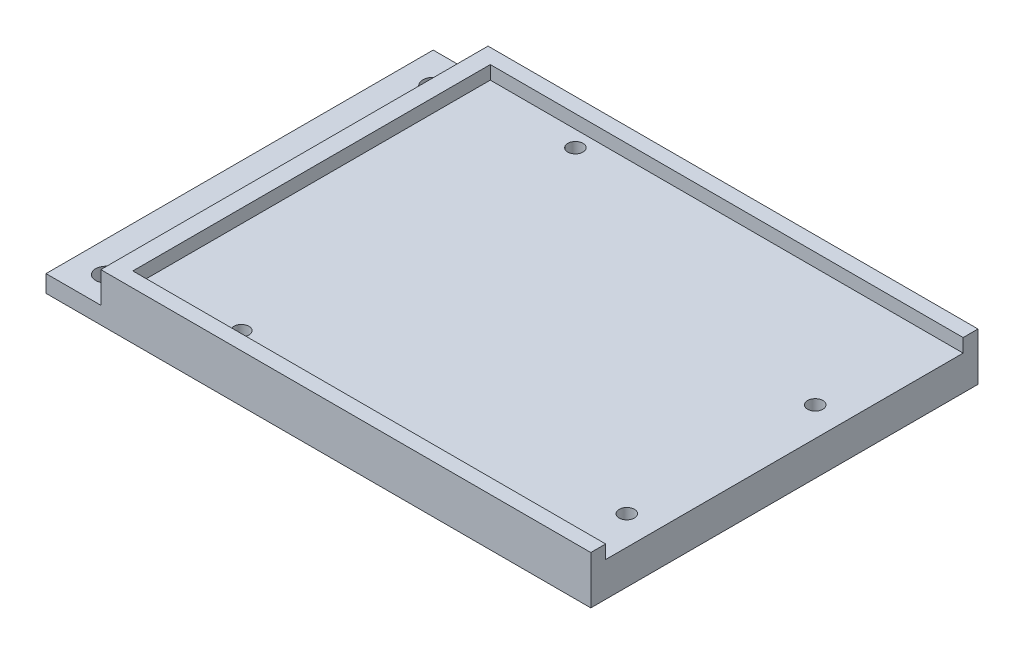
from build123d import *

# Parameters (mm, degrees)
SKETCH1_W               = 80.772
SKETCH1_H               = 57.404
BOSS_EXTRUDE1_DEPTH     = 7.112
CUT_EXTRUDE1_DEPTH      = 71.546642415
CUT_EXTRUDE1_DEPTH_BACK = 71.546642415
SKETCH2_W               = 8.128
SKETCH2_H               = 4.572
CUT_EXTRUDE3_DEPTH      = 51.054114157
CUT_EXTRUDE3_DEPTH_BACK = 51.054114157
SKETCH4_R               = 1.1303
CUT_EXTRUDE2_DEPTH      = 50.756778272
CUT_EXTRUDE2_DEPTH_BACK = 50.756778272
SKETCH3_R               = 1.524
SKETCH5_W               = 70.104
SKETCH5_H               = 52.999999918
CUT_EXTRUDE4_DEPTH      = 2


with BuildPart() as part:
    # Sketch1 → Boss-Extrude1 (new body)
    with BuildSketch(Plane(origin=(0, 0, 0), x_dir=(1, 0, 0), z_dir=(0, 1, 0))):
        Rectangle(SKETCH1_W, SKETCH1_H)
    extrude(amount=BOSS_EXTRUDE1_DEPTH)

    # Sketch2 → Cut-Extrude1 (cut, two sides: drawn at the far end of the back side and taken through both)
    with BuildSketch(Plane.XY.offset(28.702).offset(-CUT_EXTRUDE1_DEPTH_BACK)):
        with Locations((-36.322, 4.826)):
            Rectangle(SKETCH2_W, SKETCH2_H)
    extrude(amount=CUT_EXTRUDE1_DEPTH + CUT_EXTRUDE1_DEPTH_BACK, mode=Mode.SUBTRACT)

    # Sketch4 → Cut-Extrude3 (cut, two sides: drawn at the far end of the back side and taken through both)
    with BuildSketch(Plane(origin=(0, 7.112, 0), x_dir=(1, 0, 0), z_dir=(0, 1, 0)).offset(-CUT_EXTRUDE3_DEPTH_BACK)):
        with Locations(Location((-14.732, 24.13, 0), (0, 0, 270))):
            Circle(SKETCH4_R)
        with Locations(Location((-16.002, -24.13, 0), (0, 0, 270))):
            Circle(SKETCH4_R)
        with Locations(Location((36.068, 8.89, 0), (0, 0, 270))):
            Circle(SKETCH4_R)
        with Locations(Location((36.068, -19.05, 0), (0, 0, 270))):
            Circle(SKETCH4_R)
    extrude(amount=CUT_EXTRUDE3_DEPTH + CUT_EXTRUDE3_DEPTH_BACK, mode=Mode.SUBTRACT)

    # Sketch3 → Cut-Extrude2 (cut, two sides: drawn at the far end of the back side and taken through both)
    with BuildSketch(Plane(origin=(0, 2.54, 0), x_dir=(1, 0, 0), z_dir=(0, 1, 0)).offset(-CUT_EXTRUDE2_DEPTH_BACK)):
        with Locations(Location((-35.814, -24.384, 0), (0, 0, 180))):
            Circle(SKETCH3_R)
        with Locations(Location((-35.814, 24.13, 0), (0, 0, 180))):
            Circle(SKETCH3_R)
    extrude(amount=CUT_EXTRUDE2_DEPTH + CUT_EXTRUDE2_DEPTH_BACK, mode=Mode.SUBTRACT)

    # Sketch5 → Cut-Extrude4 (cut)
    with BuildSketch(Plane(origin=(0, 7.112, 0), x_dir=(1, 0, 0), z_dir=(0, 1, 0))):
        with Locations((5.334, 0)):
            Rectangle(SKETCH5_W, SKETCH5_H)
    extrude(amount=-CUT_EXTRUDE4_DEPTH, mode=Mode.SUBTRACT)


solid = part.part
